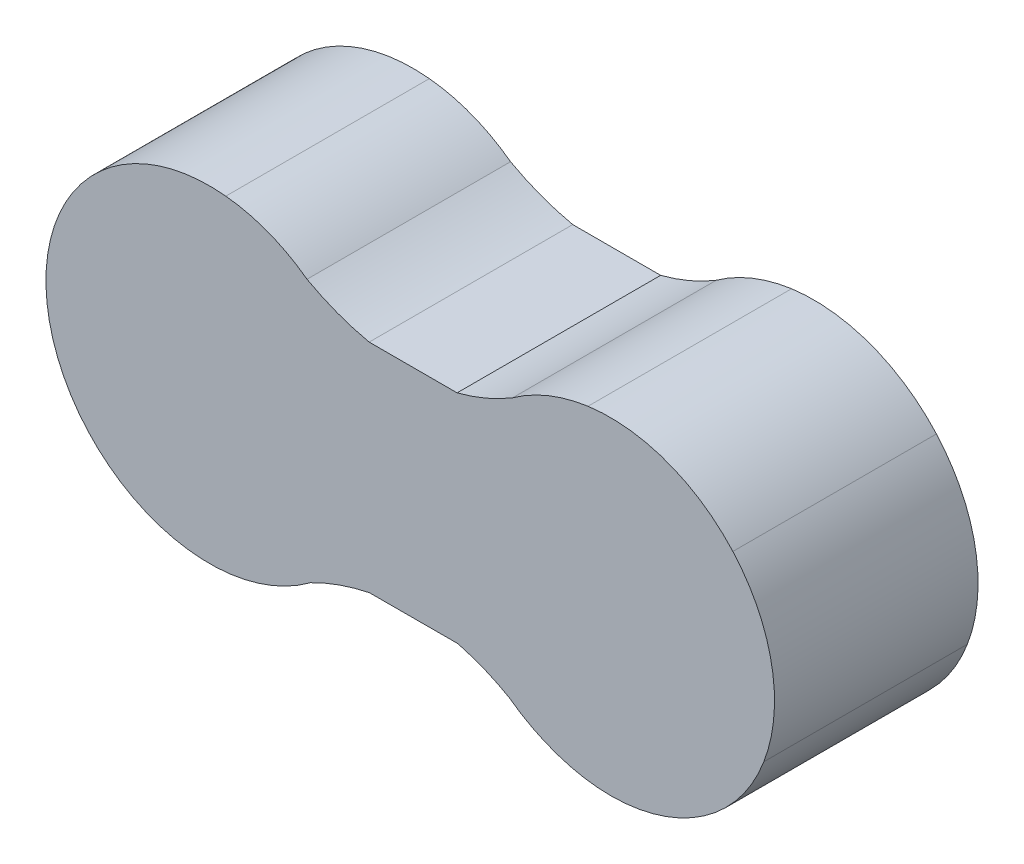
from build123d import *

# Parameters (mm, degrees)
BOSS_EXTRUDE1_DEPTH = 0.508
BOSS_EXTRUDE7_DEPTH = 0.508


with BuildPart() as part:
    # GENERAL → Boss-Extrude1 (new body)
    with BuildSketch(Plane.XY):
        Polygon((0.118141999, 0.267204), (-0.101674, 0.267204), (-0.107510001, 0.269542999), (-0.118094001, 0.271783), (-0.127613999, 0.273910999), (-0.144343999, 0.278097), (-0.152575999, 0.280449), (-0.163636, 0.283935), (-0.173268, 0.28692), (-0.182088, 0.290069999), (-0.19683, 0.29574), (-0.21195, 0.301787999), (-0.218627, 0.30491), (-0.223926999, 0.307334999), (-0.232652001, 0.311509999), (-0.235727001, 0.313085), (-0.237359, 0.313922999), (-0.239493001, 0.315001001), (-0.242628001, 0.316618), (-0.244409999, 0.317564), (-0.247280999, 0.319104), (-0.249459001, 0.320281), (-0.251635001, 0.321495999), (-0.252768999, 0.322126), (-0.257747, 0.325758), (-0.26426, 0.330515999), (-0.272957, 0.336521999), (-0.280444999, 0.341474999), (-0.289220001, 0.346935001), (-0.298112, 0.352161), (-0.306028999, 0.356567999), (-0.315466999, 0.361560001), (-0.325061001, 0.366279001), (-0.331964, 0.369437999), (-0.341401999, 0.373572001), (-0.343421, 0.374434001), (-0.354558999, 0.378909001), (-0.362191, 0.381740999), (-0.364902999, 0.382676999), (-0.379176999, 0.387548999), (-0.389923, 0.390573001), (-0.414061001, 0.396675), (-0.433501, 0.400509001), (-0.452185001, 0.403046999), (-0.466927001, 0.404396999), (-0.482317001, 0.405477), (-0.497599, 0.405855), (-0.510892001, 0.405666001), (-0.522483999, 0.405126), (-0.530332, 0.404657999), (-0.53998, 0.40383), (-0.55096, 0.40257), (-0.578466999, 0.398404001), (-0.623119, 0.386875), (-0.650752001, 0.376993), (-0.681861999, 0.363451), (-0.716815, 0.343321), (-0.757623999, 0.314041), (-0.782146, 0.291532), (-0.802825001, 0.271219), (-0.824235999, 0.244683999), (-0.839424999, 0.223273), (-0.861385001, 0.185941), (-0.872364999, 0.162334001), (-0.881092, 0.140156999), (-0.884941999, 0.130256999), (-0.892092, 0.107707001), (-0.900067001, 0.071682), (-0.904467, 0.040882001), (-0.906392, 0.006231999), (-0.906392, -0.011368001), (-0.904191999, -0.046843), (-0.900892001, -0.068293), (-0.894292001, -0.100468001), (-0.887691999, -0.122743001), (-0.880542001, -0.144467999), (-0.868166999, -0.172793), (-0.850567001, -0.206617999), (-0.831042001, -0.236318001), (-0.817774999, -0.254454), (-0.804355, -0.270192), (-0.794229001, -0.281049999), (-0.773732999, -0.301058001), (-0.754518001, -0.317711), (-0.737423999, -0.330809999), (-0.723897, -0.339963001), (-0.713691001, -0.346443), (-0.696175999, -0.356610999), (-0.670508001, -0.369651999), (-0.650014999, -0.378139), (-0.628280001, -0.386419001), (-0.599507, -0.394699), (-0.575702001, -0.400081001), (-0.547756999, -0.404221), (-0.523538, -0.406498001), (-0.502009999, -0.407119), (-0.463922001, -0.405669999), (-0.447776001, -0.403600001), (-0.413413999, -0.398011), (-0.391886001, -0.392628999), (-0.363527, -0.383521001), (-0.340963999, -0.375034), (-0.323162, -0.366961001), (-0.298528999, -0.353713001), (-0.260374, -0.329545), (-0.249058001, -0.322369), (-0.234154, -0.315055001), (-0.207934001, -0.302773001), (-0.18682, -0.294493), (-0.174124, -0.289939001), (-0.145144, -0.280969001), (-0.126513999, -0.276415), (-0.110230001, -0.272550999), (-0.101260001, -0.270204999), (-0.088564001, -0.270204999), (0.118602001, -0.269856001), (0.126799, -0.271888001), (0.143772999, -0.276856), (0.163230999, -0.283273), (0.179997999, -0.289483), (0.205922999, -0.300206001), (0.222345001, -0.308347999), (0.238215, -0.316489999), (0.260846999, -0.329876), (0.273925, -0.338199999), (0.276549, -0.340086), (0.293271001, -0.350423), (0.307592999, -0.358699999), (0.320148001, -0.365303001), (0.341423, -0.375002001), (0.359343, -0.382281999), (0.382722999, -0.390122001), (0.399663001, -0.394881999), (0.422062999, -0.400061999), (0.442923, -0.403701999), (0.462662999, -0.405942), (0.481702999, -0.407202), (0.505223, -0.407761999), (0.527623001, -0.406922), (0.554222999, -0.404262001), (0.573823, -0.401321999), (0.593703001, -0.397122), (0.612743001, -0.392221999), (0.635843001, -0.385082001), (0.662303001, -0.374581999), (0.682043, -0.365202), (0.706402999, -0.352322), (0.731882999, -0.335802), (0.754283, -0.319562), (0.767723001, -0.308222), (0.785503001, -0.291842), (0.799222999, -0.277842), (0.820083, -0.253342), (0.830443, -0.239482), (0.840383, -0.225062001), (0.855348, -0.20196), (0.873828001, -0.164369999), (0.888948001, -0.125310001), (0.897768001, -0.09381), (0.902807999, -0.065670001), (0.905538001, -0.04677), (0.907637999, -0.026400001), (0.908268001, -0.000780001), (0.907232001, 0.02526), (0.901511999, 0.070877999), (0.896055, 0.095702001), (0.894021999, 0.102978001), (0.878854, 0.149887), (0.860660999, 0.189815), (0.848746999, 0.209778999), (0.835062, 0.231191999), (0.817674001, 0.254215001), (0.804633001, 0.269188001), (0.792718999, 0.281584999), (0.782575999, 0.291889), (0.768498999, 0.305097), (0.760263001, 0.311771), (0.753802, 0.317309), (0.741230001, 0.326776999), (0.728069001, 0.335979), (0.716481, 0.343546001), (0.707037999, 0.349226), (0.695323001, 0.355899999), (0.678776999, 0.364162), (0.664759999, 0.370796), (0.655986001, 0.374434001), (0.639958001, 0.380769), (0.604301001, 0.392353), (0.567015, 0.400135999), (0.534797, 0.403937), (0.506426, 0.405254), (0.483076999, 0.404891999), (0.444886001, 0.401634), (0.410858, 0.395479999), (0.379726, 0.386973), (0.342440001, 0.373217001), (0.318186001, 0.361995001), (0.289768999, 0.346066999), (0.257550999, 0.326157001), (0.227324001, 0.308781), (0.217031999, 0.303615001), (0.204448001, 0.297686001), (0.184967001, 0.289458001), (0.166938, 0.282682), (0.143827, 0.274816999), (0.123001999, 0.268920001), align=None)
    extrude(amount=BOSS_EXTRUDE1_DEPTH)

    # Sketch1 → Boss-Extrude7 (add)
    # profile 1 of 2: a face of its own
    with BuildSketch(Plane.XY.offset(0.508)):
        with BuildLine():
            ThreePointArc((-0.256661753, 0.327443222), (-0.181198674, 0.292627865), (-0.101460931, 0.269204))
            Line((-0.101460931, 0.269204), (-0.09768247, 0.269204))
            Line((-0.09768247, 0.269204), (0.11788626, 0.269204))
            ThreePointArc((0.11788626, 0.269204), (0.189304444, 0.293461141), (0.256446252, 0.327825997))
            ThreePointArc((0.256446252, 0.327825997), (0.34594963, 0.377087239), (0.444609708, 0.403614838))
            ThreePointArc((0.444609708, 0.403614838), (0.641915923, 0.382022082), (0.80612263, 0.270522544))
            ThreePointArc((0.80612263, 0.270522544), (0.903265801, 0.073345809), (0.883257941, -0.145549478))
            ThreePointArc((0.883257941, -0.145549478), (0.704196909, -0.355901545), (0.432146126, -0.4038517))
            ThreePointArc((0.432146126, -0.4038517), (0.335755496, -0.374897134), (0.248431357, -0.324857))
            ThreePointArc((0.248431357, -0.324857), (0.189047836, -0.29531164), (0.126297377, -0.273824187))
            Line((0.126297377, -0.273824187), (0.118359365, -0.271856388))
            Line((0.118359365, -0.271856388), (-0.101053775, -0.272204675))
            ThreePointArc((-0.101053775, -0.272204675), (-0.176281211, -0.293164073), (-0.247996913, -0.324072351))
            ThreePointArc((-0.247996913, -0.324072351), (-0.309787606, -0.362442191), (-0.377106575, -0.389982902))
            ThreePointArc((-0.377106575, -0.389982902), (-0.624277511, -0.389423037), (-0.826003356, -0.246592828))
            ThreePointArc((-0.826003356, -0.246592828), (-0.890968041, -0.11876196), (-0.907425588, 0.02368203))
            ThreePointArc((-0.907425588, 0.02368203), (-0.866985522, 0.177408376), (-0.771218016, 0.304277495))
            ThreePointArc((-0.771218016, 0.304277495), (-0.625965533, 0.387827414), (-0.459355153, 0.405711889))
            ThreePointArc((-0.459355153, 0.405711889), (-0.352693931, 0.380340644), (-0.256661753, 0.327443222))
        make_face()
        with BuildLine():
            ThreePointArc((-0.459556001, 0.403721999), (-0.353354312, 0.378451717), (-0.257747, 0.325758))
            ThreePointArc((-0.257747, 0.325758), (-0.181863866, 0.290741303), (-0.101674, 0.267204))
            Line((-0.101674, 0.267204), (-0.09768247, 0.267204))
            Line((-0.09768247, 0.267204), (0.118141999, 0.267204))
            ThreePointArc((0.118141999, 0.267204), (0.190001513, 0.291584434), (0.257550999, 0.326157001))
            ThreePointArc((0.257550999, 0.326157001), (0.346657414, 0.375216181), (0.444886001, 0.401634))
            ThreePointArc((0.444886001, 0.401634), (0.641228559, 0.380143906), (0.804633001, 0.269188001))
            ThreePointArc((0.804633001, 0.269188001), (0.901299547, 0.072979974), (0.881388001, -0.14484))
            ThreePointArc((0.881388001, -0.14484), (0.703208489, -0.354162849), (0.432493, -0.401881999))
            ThreePointArc((0.432493, -0.401881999), (0.336493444, -0.373037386), (0.249531, -0.323183))
            ThreePointArc((0.249531, -0.323183), (0.189858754, -0.293482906), (0.126799, -0.271888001))
            Line((0.126799, -0.271888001), (0.118602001, -0.269856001))
            Line((0.118602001, -0.269856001), (-0.101260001, -0.270204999))
            ThreePointArc((-0.101260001, -0.270204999), (-0.176929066, -0.291271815), (-0.249058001, -0.322369))
            ThreePointArc((-0.249058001, -0.322369), (-0.310623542, -0.360623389), (-0.3777065, -0.388075))
            ThreePointArc((-0.3777065, -0.388075), (-0.623668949, -0.387517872), (-0.8244085, -0.245386))
            ThreePointArc((-0.8244085, -0.245386), (-0.889053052, -0.118185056), (-0.9054295, 0.023557))
            ThreePointArc((-0.9054295, 0.023557), (-0.8651863, 0.176534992), (-0.769884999, 0.3027865))
            ThreePointArc((-0.769884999, 0.3027865), (-0.625346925, 0.385925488), (-0.459556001, 0.403721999))
        make_face(mode=Mode.SUBTRACT)
    # profile 2 of 2: a face of its own
    with BuildSketch(Plane.XY.offset(0.508)):
        with BuildLine():
            ThreePointArc((-0.257747, 0.325758), (-0.181863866, 0.290741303), (-0.101674, 0.267204))
            Line((-0.101674, 0.267204), (-0.09768247, 0.267204))
            Line((-0.09768247, 0.267204), (0.118141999, 0.267204))
            ThreePointArc((0.118141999, 0.267204), (0.190001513, 0.291584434), (0.257550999, 0.326157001))
            ThreePointArc((0.257550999, 0.326157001), (0.346657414, 0.375216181), (0.444886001, 0.401634))
            ThreePointArc((0.444886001, 0.401634), (0.641228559, 0.380143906), (0.804633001, 0.269188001))
            ThreePointArc((0.804633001, 0.269188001), (0.901299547, 0.072979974), (0.881388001, -0.14484))
            ThreePointArc((0.881388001, -0.14484), (0.703208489, -0.354162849), (0.432493, -0.401881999))
            ThreePointArc((0.432493, -0.401881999), (0.336493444, -0.373037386), (0.249531, -0.323183))
            ThreePointArc((0.249531, -0.323183), (0.189858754, -0.293482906), (0.126799, -0.271888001))
            Line((0.126799, -0.271888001), (0.118602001, -0.269856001))
            Line((0.118602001, -0.269856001), (-0.101260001, -0.270204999))
            ThreePointArc((-0.101260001, -0.270204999), (-0.176929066, -0.291271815), (-0.249058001, -0.322369))
            ThreePointArc((-0.249058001, -0.322369), (-0.310623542, -0.360623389), (-0.3777065, -0.388075))
            ThreePointArc((-0.3777065, -0.388075), (-0.623668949, -0.387517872), (-0.8244085, -0.245386))
            ThreePointArc((-0.8244085, -0.245386), (-0.889053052, -0.118185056), (-0.9054295, 0.023557))
            ThreePointArc((-0.9054295, 0.023557), (-0.8651863, 0.176534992), (-0.769884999, 0.3027865))
            ThreePointArc((-0.769884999, 0.3027865), (-0.625346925, 0.385925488), (-0.459556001, 0.403721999))
            ThreePointArc((-0.459556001, 0.403721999), (-0.353354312, 0.378451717), (-0.257747, 0.325758))
        make_face()
        with BuildLine():
            ThreePointArc((-0.459756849, 0.40173211), (-0.35401496, 0.376562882), (-0.258832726, 0.324073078))
            ThreePointArc((-0.258832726, 0.324073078), (-0.182529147, 0.288854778), (-0.101886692, 0.265204))
            Line((-0.101886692, 0.265204), (-0.09768247, 0.265204))
            Line((-0.09768247, 0.265204), (0.118397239, 0.265204))
            ThreePointArc((0.118397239, 0.265204), (0.190698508, 0.28970771), (0.258656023, 0.324488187))
            ThreePointArc((0.258656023, 0.324488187), (0.347365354, 0.373345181), (0.445162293, 0.399653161))
            ThreePointArc((0.445162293, 0.399653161), (0.640541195, 0.378265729), (0.803143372, 0.267853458))
            ThreePointArc((0.803143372, 0.267853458), (0.899333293, 0.07261414), (0.879518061, -0.144130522))
            ThreePointArc((0.879518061, -0.144130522), (0.702220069, -0.352424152), (0.432839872, -0.399912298))
            ThreePointArc((0.432839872, -0.399912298), (0.337231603, -0.37117772), (0.250631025, -0.321509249))
            ThreePointArc((0.250631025, -0.321509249), (0.190669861, -0.291654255), (0.127300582, -0.269951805))
            Line((0.127300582, -0.269951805), (0.118844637, -0.267855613))
            Line((0.118844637, -0.267855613), (-0.101465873, -0.268205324))
            ThreePointArc((-0.101465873, -0.268205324), (-0.177577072, -0.289379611), (-0.25011966, -0.320665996))
            ThreePointArc((-0.25011966, -0.320665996), (-0.311459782, -0.358804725), (-0.378306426, -0.386167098))
            ThreePointArc((-0.378306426, -0.386167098), (-0.623060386, -0.385612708), (-0.822813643, -0.244179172))
            ThreePointArc((-0.822813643, -0.244179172), (-0.887138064, -0.117608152), (-0.903433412, 0.02343197))
            ThreePointArc((-0.903433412, 0.02343197), (-0.863387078, 0.175661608), (-0.768551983, 0.301295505))
            ThreePointArc((-0.768551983, 0.301295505), (-0.624728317, 0.384023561), (-0.459756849, 0.40173211))
        make_face(mode=Mode.SUBTRACT)
    extrude(amount=-BOSS_EXTRUDE7_DEPTH)


solid = part.part
